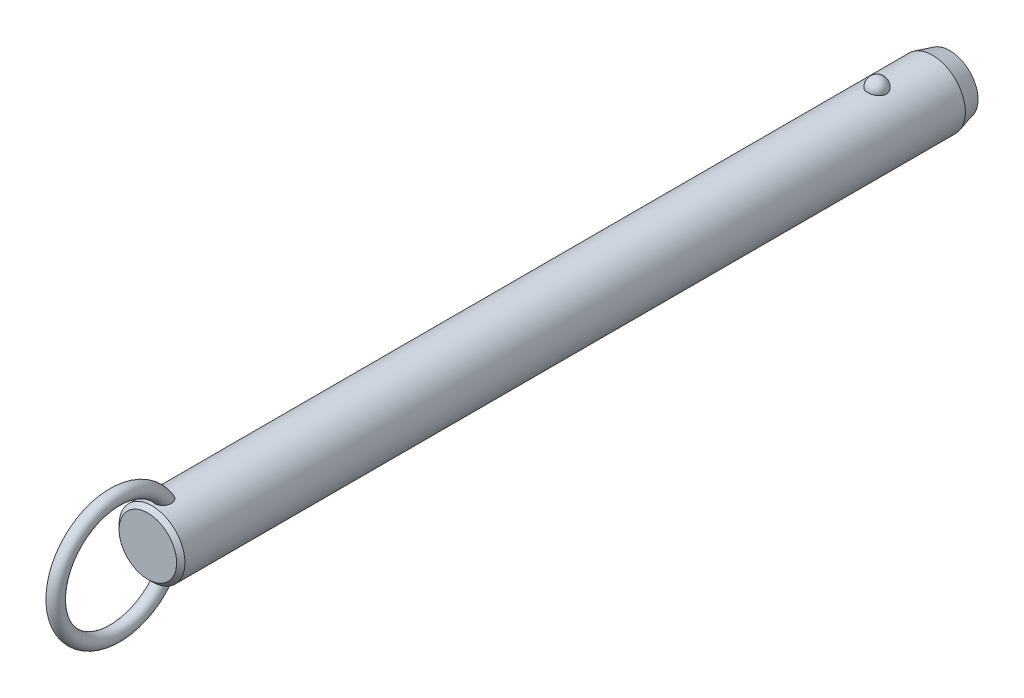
ISO-10303-21;
HEADER;
FILE_DESCRIPTION(('STEP AP214'),'2;1');
FILE_NAME('part.step','',(''),(''),'','','');
FILE_SCHEMA(('AUTOMOTIVE_DESIGN { 1 0 10303 214 1 1 1 1 }'));
ENDSEC;
DATA;
#1=APPLICATION_CONTEXT('core data for automotive mechanical design processes');
#2=APPLICATION_PROTOCOL_DEFINITION('international standard','automotive_design',2000,#1);
#3=PRODUCT_CONTEXT('',#1,'mechanical');
#4=PRODUCT('Part','Part','',(#3));
#5=PRODUCT_RELATED_PRODUCT_CATEGORY('part','',(#4));
#6=PRODUCT_DEFINITION_FORMATION('','',#4);
#7=PRODUCT_DEFINITION_CONTEXT('part definition',#1,'design');
#8=PRODUCT_DEFINITION('design','',#6,#7);
#9=PRODUCT_DEFINITION_SHAPE('','',#8);
#10=(LENGTH_UNIT() NAMED_UNIT(*) SI_UNIT(.MILLI.,.METRE.));
#11=(NAMED_UNIT(*) PLANE_ANGLE_UNIT() SI_UNIT($,.RADIAN.));
#12=(NAMED_UNIT(*) SI_UNIT($,.STERADIAN.) SOLID_ANGLE_UNIT());
#13=UNCERTAINTY_MEASURE_WITH_UNIT(LENGTH_MEASURE(1.E-05),#10,'distance_accuracy_value','');
#14=(GEOMETRIC_REPRESENTATION_CONTEXT(3) GLOBAL_UNCERTAINTY_ASSIGNED_CONTEXT((#13)) GLOBAL_UNIT_ASSIGNED_CONTEXT((#10,
#11,#12)) REPRESENTATION_CONTEXT('',''));
#15=CARTESIAN_POINT('',(0.,0.,0.));
#16=DIRECTION('',(0.,0.,1.));
#17=DIRECTION('',(1.,0.,0.));
#18=AXIS2_PLACEMENT_3D('',#15,#16,#17);
#19=CARTESIAN_POINT('',(0.,0.,198.12));
#20=DIRECTION('',(0.,0.,-1.));
#21=DIRECTION('',(-1.,0.,0.));
#22=AXIS2_PLACEMENT_3D('',#19,#20,#21);
#23=CYLINDRICAL_SURFACE('',#22,9.5);
#24=CARTESIAN_POINT('',(2.67259918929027,9.11631578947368,-2.70000000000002));
#25=CARTESIAN_POINT('',(2.6725968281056,9.11631786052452,-2.54909854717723));
#26=CARTESIAN_POINT('',(2.66030567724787,9.11994722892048,-2.39816735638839));
#27=CARTESIAN_POINT('',(2.6114347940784,9.13405924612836,-2.10058568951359));
#28=CARTESIAN_POINT('',(2.57484658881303,9.14454428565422,-1.95393672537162));
#29=CARTESIAN_POINT('',(2.47830875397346,9.17117631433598,-1.66916069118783));
#30=CARTESIAN_POINT('',(2.41836936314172,9.18732082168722,-1.53102991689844));
#31=CARTESIAN_POINT('',(2.27661331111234,9.22346780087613,-1.26705393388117));
#32=CARTESIAN_POINT('',(2.19479699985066,9.24347021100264,-1.14120852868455));
#33=CARTESIAN_POINT('',(2.01085282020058,9.28522401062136,-0.904632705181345));
#34=CARTESIAN_POINT('',(1.90862396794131,9.30698376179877,-0.793982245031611));
#35=CARTESIAN_POINT('',(1.6867437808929,9.34973971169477,-0.59160721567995));
#36=CARTESIAN_POINT('',(1.56709244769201,9.37073591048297,-0.499882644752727));
#37=CARTESIAN_POINT('',(1.31393976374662,9.40956370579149,-0.338167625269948));
#38=CARTESIAN_POINT('',(1.18048026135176,9.42740444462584,-0.268113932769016));
#39=CARTESIAN_POINT('',(0.903154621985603,9.45799906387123,-0.151390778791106));
#40=CARTESIAN_POINT('',(0.759289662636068,9.47075351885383,-0.104718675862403));
#41=CARTESIAN_POINT('',(0.468074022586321,9.48956256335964,-0.0367633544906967));
#42=CARTESIAN_POINT('',(0.320836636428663,9.49573643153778,-0.0150275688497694));
#43=CARTESIAN_POINT('',(0.0246714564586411,9.50112183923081,0.00396199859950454));
#44=CARTESIAN_POINT('',(-0.124256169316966,9.50033406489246,0.00121819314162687));
#45=CARTESIAN_POINT('',(-0.417264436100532,9.4919475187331,-0.0284441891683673));
#46=CARTESIAN_POINT('',(-0.56138413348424,9.48444885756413,-0.0550074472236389));
#47=CARTESIAN_POINT('',(-0.842986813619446,9.46357853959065,-0.131064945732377));
#48=CARTESIAN_POINT('',(-0.980469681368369,9.450206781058,-0.180559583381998));
#49=CARTESIAN_POINT('',(-1.24585005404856,9.41890822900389,-0.301476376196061));
#50=CARTESIAN_POINT('',(-1.37368611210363,9.40095498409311,-0.373026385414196));
#51=CARTESIAN_POINT('',(-1.61552738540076,9.36242964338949,-0.536025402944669));
#52=CARTESIAN_POINT('',(-1.72953116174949,9.34185727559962,-0.627476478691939));
#53=CARTESIAN_POINT('',(-1.9429225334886,9.29984568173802,-0.829844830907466));
#54=CARTESIAN_POINT('',(-2.04198021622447,9.27839736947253,-0.941108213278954));
#55=CARTESIAN_POINT('',(-2.22026460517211,9.23735994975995,-1.17883414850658));
#56=CARTESIAN_POINT('',(-2.29948985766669,9.21777097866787,-1.30529781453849));
#57=CARTESIAN_POINT('',(-2.43697287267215,9.18238994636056,-1.57158566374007));
#58=CARTESIAN_POINT('',(-2.49497068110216,9.16664569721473,-1.71155057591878));
#59=CARTESIAN_POINT('',(-2.5872073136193,9.14104303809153,-1.99961197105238));
#60=CARTESIAN_POINT('',(-2.62144683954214,9.13118445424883,-2.1477082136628));
#61=CARTESIAN_POINT('',(-2.66521466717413,9.11850622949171,-2.44715424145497));
#62=CARTESIAN_POINT('',(-2.67484831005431,9.11565658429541,-2.59848735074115));
#63=CARTESIAN_POINT('',(-2.66946735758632,9.11723375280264,-2.90067317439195));
#64=CARTESIAN_POINT('',(-2.65445345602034,9.12166036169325,-3.05152590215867));
#65=CARTESIAN_POINT('',(-2.60029711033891,9.13724422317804,-3.34766110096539));
#66=CARTESIAN_POINT('',(-2.56127978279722,9.14836656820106,-3.49296833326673));
#67=CARTESIAN_POINT('',(-2.46018844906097,9.17606676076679,-3.77477535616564));
#68=CARTESIAN_POINT('',(-2.39811349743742,9.1926448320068,-3.91127478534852));
#69=CARTESIAN_POINT('',(-2.25202303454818,9.22952198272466,-4.17244273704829));
#70=CARTESIAN_POINT('',(-2.16788714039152,9.24984129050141,-4.29704106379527));
#71=CARTESIAN_POINT('',(-1.9799408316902,9.29188255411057,-4.53013066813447));
#72=CARTESIAN_POINT('',(-1.87612963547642,9.31360456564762,-4.63862130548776));
#73=CARTESIAN_POINT('',(-1.65105429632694,9.35612959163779,-4.83690299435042));
#74=CARTESIAN_POINT('',(-1.52972405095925,9.37692871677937,-4.9266199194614));
#75=CARTESIAN_POINT('',(-1.27318250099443,9.41518970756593,-5.08429106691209));
#76=CARTESIAN_POINT('',(-1.13797219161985,9.432651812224,-5.15224684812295));
#77=CARTESIAN_POINT('',(-0.859280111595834,9.46208255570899,-5.26371827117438));
#78=CARTESIAN_POINT('',(-0.715925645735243,9.47411833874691,-5.30753421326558));
#79=CARTESIAN_POINT('',(-0.423550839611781,9.4916822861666,-5.37076321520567));
#80=CARTESIAN_POINT('',(-0.2745312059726,9.49721125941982,-5.39017930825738));
#81=CARTESIAN_POINT('',(0.0218446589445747,9.50110860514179,-5.40390587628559));
#82=CARTESIAN_POINT('',(0.16917707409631,9.49961381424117,-5.39869609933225));
#83=CARTESIAN_POINT('',(0.460808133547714,9.48993906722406,-5.36441955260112));
#84=CARTESIAN_POINT('',(0.605106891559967,9.48175936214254,-5.33535367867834));
#85=CARTESIAN_POINT('',(0.886027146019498,9.4596376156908,-5.25435587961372));
#86=CARTESIAN_POINT('',(1.02267710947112,9.44571881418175,-5.20251612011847));
#87=CARTESIAN_POINT('',(1.28523827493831,9.41358993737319,-5.07741549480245));
#88=CARTESIAN_POINT('',(1.41114877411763,9.39537958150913,-5.00415322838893));
#89=CARTESIAN_POINT('',(1.65085227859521,9.3562644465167,-4.83684599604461));
#90=CARTESIAN_POINT('',(1.76442346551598,9.33532178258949,-4.74249218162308));
#91=CARTESIAN_POINT('',(1.97425672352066,9.29321198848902,-4.53620389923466));
#92=CARTESIAN_POINT('',(2.07051582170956,9.27204482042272,-4.42426641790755));
#93=CARTESIAN_POINT('',(2.24490086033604,9.23139221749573,-4.18363183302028));
#94=CARTESIAN_POINT('',(2.32267019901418,9.21194380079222,-4.05466990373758));
#95=CARTESIAN_POINT('',(2.45584092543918,9.1773419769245,-3.78517836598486));
#96=CARTESIAN_POINT('',(2.5112497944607,9.16218713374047,-3.644652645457));
#97=CARTESIAN_POINT('',(2.59380876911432,9.13913522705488,-3.37104301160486));
#98=CARTESIAN_POINT('',(2.62330266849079,9.13064624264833,-3.23871053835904));
#99=CARTESIAN_POINT('',(2.66269870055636,9.11923566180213,-2.97092664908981));
#100=CARTESIAN_POINT('',(2.67260130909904,9.11631393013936,-2.83547530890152));
#101=CARTESIAN_POINT('',(2.67259918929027,9.11631578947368,-2.70000000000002));
#102=B_SPLINE_CURVE_WITH_KNOTS('',3,(#24,#25,#26,#27,#28,#29,#30,#31,#32,#33,#34,#35,#36,#37,
#38,#39,#40,#41,#42,#43,#44,#45,#46,#47,#48,#49,#50,#51,#52,#53,#54,#55,#56,#57,#58,#59,#60,#61,
#62,#63,#64,#65,#66,#67,#68,#69,#70,#71,#72,#73,#74,#75,#76,#77,#78,#79,#80,#81,#82,#83,#84,#85,
#86,#87,#88,#89,#90,#91,#92,#93,#94,#95,#96,#97,#98,#99,#100,#101),.UNSPECIFIED.,.T.,.F.,(4,2,2,
2,2,2,2,2,2,2,2,2,2,2,2,2,2,2,2,2,2,2,2,2,2,2,2,2,2,2,2,2,2,2,2,2,2,2,4),(0.,0.452217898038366,
0.904593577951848,1.35677112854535,1.80894144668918,2.26340676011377,2.71787203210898,
3.17099820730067,3.62407318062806,4.0687883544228,4.51345969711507,4.95160616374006,
5.38976021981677,5.83050358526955,6.27129275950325,6.72071308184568,7.17016633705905,
7.62495278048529,8.07972578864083,8.53254856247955,8.98535859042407,9.43582813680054,
9.88631615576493,10.3393155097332,10.7923328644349,11.2471065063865,11.7018475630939,
12.150795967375,12.599688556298,13.0398725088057,13.4800399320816,13.9184421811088,
14.3568730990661,14.802202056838,15.2476074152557,15.7010097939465,16.1542603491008,
16.5602594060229,16.966248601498),.UNSPECIFIED.);
#103=CARTESIAN_POINT('',(2.67259918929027,9.11631578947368,-2.70000000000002));
#104=VERTEX_POINT('',#103);
#105=EDGE_CURVE('E41',#104,#104,#102,.T.);
#106=ORIENTED_EDGE('',*,*,#105,.T.);
#107=EDGE_LOOP('',(#106));
#108=FACE_BOUND('',#107,.T.);
#109=CARTESIAN_POINT('',(0.,0.,206.44));
#110=DIRECTION('',(0.,0.,1.));
#111=DIRECTION('',(1.,0.,0.));
#112=AXIS2_PLACEMENT_3D('',#109,#110,#111);
#113=CIRCLE('',#112,9.5);
#114=CARTESIAN_POINT('',(9.5,0.,206.44));
#115=VERTEX_POINT('',#114);
#116=EDGE_CURVE('E10',#115,#115,#113,.F.);
#117=ORIENTED_EDGE('',*,*,#116,.T.);
#118=EDGE_LOOP('',(#117));
#119=FACE_BOUND('',#118,.T.);
#120=CARTESIAN_POINT('',(-0.697062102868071,-9.47439269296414,200.787808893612));
#121=CARTESIAN_POINT('',(-0.799579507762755,-9.46685146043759,200.827482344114));
#122=CARTESIAN_POINT('',(-0.898575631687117,-9.45788043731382,200.8759309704));
#123=CARTESIAN_POINT('',(-1.08670047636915,-9.43811593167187,200.988868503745));
#124=CARTESIAN_POINT('',(-1.17583204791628,-9.42732297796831,201.053352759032));
#125=CARTESIAN_POINT('',(-1.34179806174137,-9.40513672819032,201.196209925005));
#126=CARTESIAN_POINT('',(-1.41865133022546,-9.39374438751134,201.274561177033));
#127=CARTESIAN_POINT('',(-1.5586004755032,-9.37154196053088,201.442752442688));
#128=CARTESIAN_POINT('',(-1.62169476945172,-9.3607319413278,201.53259377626));
#129=CARTESIAN_POINT('',(-1.73527695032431,-9.34035749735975,201.724500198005));
#130=CARTESIAN_POINT('',(-1.78522266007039,-9.33085270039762,201.826891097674));
#131=CARTESIAN_POINT('',(-1.86924997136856,-9.3143834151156,202.038148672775));
#132=CARTESIAN_POINT('',(-1.90332570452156,-9.30741986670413,202.147017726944));
#133=CARTESIAN_POINT('',(-1.95893603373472,-9.29588482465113,202.380473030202));
#134=CARTESIAN_POINT('',(-1.97872420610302,-9.29165182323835,202.505489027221));
#135=CARTESIAN_POINT('',(-2.00062129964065,-9.28695978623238,202.757080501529));
#136=CARTESIAN_POINT('',(-2.00272284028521,-9.28650232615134,202.883656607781));
#137=CARTESIAN_POINT('',(-1.98958876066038,-9.28932750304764,203.156815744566));
#138=CARTESIAN_POINT('',(-1.97143366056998,-9.2932400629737,203.303251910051));
#139=CARTESIAN_POINT('',(-1.91479925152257,-9.30507151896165,203.592062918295));
#140=CARTESIAN_POINT('',(-1.87629122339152,-9.31299607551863,203.734431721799));
#141=CARTESIAN_POINT('',(-1.77225683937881,-9.33340232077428,204.035172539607));
#142=CARTESIAN_POINT('',(-1.70334898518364,-9.34641636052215,204.192369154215));
#143=CARTESIAN_POINT('',(-1.58111062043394,-9.36759153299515,204.417517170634));
#144=CARTESIAN_POINT('',(-1.53721459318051,-9.37492619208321,204.490796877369));
#145=CARTESIAN_POINT('',(-1.44302631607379,-9.38988566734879,204.63307405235));
#146=CARTESIAN_POINT('',(-1.39273721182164,-9.39751033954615,204.702073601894));
#147=CARTESIAN_POINT('',(-1.26775962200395,-9.41530678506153,204.856983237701));
#148=CARTESIAN_POINT('',(-1.19052326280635,-9.42548108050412,204.940871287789));
#149=CARTESIAN_POINT('',(-1.02420241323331,-9.44499825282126,205.096008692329));
#150=CARTESIAN_POINT('',(-0.935139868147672,-9.45434261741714,205.167280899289));
#151=CARTESIAN_POINT('',(-0.766610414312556,-9.46930670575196,205.278695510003));
#152=CARTESIAN_POINT('',(-0.689439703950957,-9.47529223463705,205.322235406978));
#153=CARTESIAN_POINT('',(-0.528942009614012,-9.48560294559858,205.39631336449));
#154=CARTESIAN_POINT('',(-0.445620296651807,-9.48992953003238,205.426862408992));
#155=CARTESIAN_POINT('',(-0.273901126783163,-9.49644161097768,205.472579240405));
#156=CARTESIAN_POINT('',(-0.18546574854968,-9.49860811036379,205.48761059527));
#157=CARTESIAN_POINT('',(-0.00734541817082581,-9.5004135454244,205.500149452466));
#158=CARTESIAN_POINT('',(0.0823387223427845,-9.50005405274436,205.497667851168));
#159=CARTESIAN_POINT('',(0.24767927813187,-9.49708301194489,205.476995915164));
#160=CARTESIAN_POINT('',(0.323620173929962,-9.49477609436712,205.460930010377));
#161=CARTESIAN_POINT('',(0.471981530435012,-9.48855917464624,205.417172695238));
#162=CARTESIAN_POINT('',(0.544400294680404,-9.48464840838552,205.389475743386));
#163=CARTESIAN_POINT('',(0.708947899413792,-9.47398336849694,205.31280266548));
#164=CARTESIAN_POINT('',(0.799149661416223,-9.46671310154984,205.259774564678));
#165=CARTESIAN_POINT('',(0.969783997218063,-9.45076225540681,205.139973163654));
#166=CARTESIAN_POINT('',(1.050194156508,-9.44207854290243,205.073169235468));
#167=CARTESIAN_POINT('',(1.23092343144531,-9.42051459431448,204.900759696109));
#168=CARTESIAN_POINT('',(1.32652499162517,-9.40733378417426,204.79026193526));
#169=CARTESIAN_POINT('',(1.49893121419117,-9.38140745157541,204.555561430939));
#170=CARTESIAN_POINT('',(1.57571616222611,-9.36866239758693,204.431344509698));
#171=CARTESIAN_POINT('',(1.71285426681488,-9.34457644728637,204.169389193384));
#172=CARTESIAN_POINT('',(1.77266365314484,-9.33328726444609,204.03136233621));
#173=CARTESIAN_POINT('',(1.87239208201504,-9.31379209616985,203.748051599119));
#174=CARTESIAN_POINT('',(1.91230158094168,-9.3055875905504,203.602764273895));
#175=CARTESIAN_POINT('',(1.97604189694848,-9.29228394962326,203.282028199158));
#176=CARTESIAN_POINT('',(1.9958743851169,-9.28797202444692,203.105724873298));
#177=CARTESIAN_POINT('',(2.0029570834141,-9.28645519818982,202.752414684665));
#178=CARTESIAN_POINT('',(1.99025930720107,-9.28923895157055,202.575409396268));
#179=CARTESIAN_POINT('',(1.93735479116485,-9.30038134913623,202.276338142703));
#180=CARTESIAN_POINT('',(1.90576827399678,-9.30697680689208,202.152667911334));
#181=CARTESIAN_POINT('',(1.8228748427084,-9.32356855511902,201.912329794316));
#182=CARTESIAN_POINT('',(1.77158213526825,-9.33356239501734,201.795656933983));
#183=CARTESIAN_POINT('',(1.64885744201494,-9.35602275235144,201.572706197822));
#184=CARTESIAN_POINT('',(1.57730995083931,-9.36850332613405,201.466492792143));
#185=CARTESIAN_POINT('',(1.41543264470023,-9.39431873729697,201.269553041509));
#186=CARTESIAN_POINT('',(1.32510883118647,-9.40765330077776,201.178821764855));
#187=CARTESIAN_POINT('',(1.13846223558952,-9.43195720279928,201.025033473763));
#188=CARTESIAN_POINT('',(1.04369890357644,-9.44302894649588,200.960094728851));
#189=CARTESIAN_POINT('',(0.843965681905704,-9.46296805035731,200.848038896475));
#190=CARTESIAN_POINT('',(0.739000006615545,-9.47183631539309,200.800914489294));
#191=CARTESIAN_POINT('',(0.528175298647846,-9.48586140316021,200.728117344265));
#192=CARTESIAN_POINT('',(0.422686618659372,-9.49119633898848,200.70140249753));
#193=CARTESIAN_POINT('',(0.208590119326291,-9.49831365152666,200.666013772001));
#194=CARTESIAN_POINT('',(0.0999817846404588,-9.500095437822,200.657342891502));
#195=CARTESIAN_POINT('',(-0.126104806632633,-9.49988861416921,200.658350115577));
#196=CARTESIAN_POINT('',(-0.243578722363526,-9.49757821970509,200.669594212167));
#197=CARTESIAN_POINT('',(-0.474390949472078,-9.48885165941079,200.713167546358));
#198=CARTESIAN_POINT('',(-0.587729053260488,-9.48243528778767,200.745497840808));
#199=CARTESIAN_POINT('',(-0.697062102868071,-9.47439269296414,200.787808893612));
#200=B_SPLINE_CURVE_WITH_KNOTS('',3,(#120,#121,#122,#123,#124,#125,#126,#127,#128,#129,#130,
#131,#132,#133,#134,#135,#136,#137,#138,#139,#140,#141,#142,#143,#144,#145,#146,#147,#148,#149,
#150,#151,#152,#153,#154,#155,#156,#157,#158,#159,#160,#161,#162,#163,#164,#165,#166,#167,#168,
#169,#170,#171,#172,#173,#174,#175,#176,#177,#178,#179,#180,#181,#182,#183,#184,#185,#186,#187,
#188,#189,#190,#191,#192,#193,#194,#195,#196,#197,#198,#199),.UNSPECIFIED.,.T.,.F.,(4,2,2,2,2,2,
2,2,2,2,2,2,2,2,2,2,2,2,2,2,2,2,2,2,2,2,2,2,2,2,2,2,2,2,2,2,2,2,2,4),(0.,0.330119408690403,
0.660143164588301,0.989655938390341,1.31920659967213,1.66074728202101,2.00241415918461,
2.38088696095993,2.75951768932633,3.20065679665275,3.64242004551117,4.15620996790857,
4.41314162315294,4.66994734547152,5.01228664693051,5.35399933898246,5.61943037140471,
5.88463652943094,6.15215502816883,6.4195070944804,6.65144391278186,6.88349136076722,
7.19641200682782,7.51003602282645,7.94779711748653,8.3860149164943,8.83699707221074,
9.28819530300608,9.81778662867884,10.34653170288,10.7284172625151,11.1100280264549,
11.4938603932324,11.8775702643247,12.2220189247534,12.5663259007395,12.8915939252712,
13.2169159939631,13.5689650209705,13.9210316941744),.UNSPECIFIED.);
#201=CARTESIAN_POINT('',(-0.697062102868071,-9.47439269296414,200.787808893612));
#202=VERTEX_POINT('',#201);
#203=EDGE_CURVE('E60',#202,#202,#200,.T.);
#204=ORIENTED_EDGE('',*,*,#203,.T.);
#205=EDGE_LOOP('',(#204));
#206=FACE_BOUND('',#205,.T.);
#207=CARTESIAN_POINT('',(-0.697062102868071,9.47439269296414,200.787808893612));
#208=CARTESIAN_POINT('',(-0.597792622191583,9.48169483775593,200.74939564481));
#209=CARTESIAN_POINT('',(-0.495106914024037,9.48766580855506,200.719168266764));
#210=CARTESIAN_POINT('',(-0.285876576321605,9.49627648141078,200.676032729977));
#211=CARTESIAN_POINT('',(-0.179324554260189,9.49890941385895,200.663159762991));
#212=CARTESIAN_POINT('',(0.0344157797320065,9.50053798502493,200.655166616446));
#213=CARTESIAN_POINT('',(0.141603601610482,9.49953613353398,200.660034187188));
#214=CARTESIAN_POINT('',(0.35356357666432,9.49401038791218,200.687365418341));
#215=CARTESIAN_POINT('',(0.458336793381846,9.48948807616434,200.70982117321));
#216=CARTESIAN_POINT('',(0.662493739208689,9.4774236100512,200.771671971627));
#217=CARTESIAN_POINT('',(0.761881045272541,9.46988348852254,200.811055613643));
#218=CARTESIAN_POINT('',(0.95260839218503,9.45260382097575,200.905634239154));
#219=CARTESIAN_POINT('',(1.04394806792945,9.44286417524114,200.960829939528));
#220=CARTESIAN_POINT('',(1.21712767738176,9.42211760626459,201.086066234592));
#221=CARTESIAN_POINT('',(1.29885671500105,9.41109835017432,201.156257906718));
#222=CARTESIAN_POINT('',(1.44978975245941,9.38903310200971,201.308980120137));
#223=CARTESIAN_POINT('',(1.51899278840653,9.37798710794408,201.391511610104));
#224=CARTESIAN_POINT('',(1.64602857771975,9.35654375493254,201.569776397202));
#225=CARTESIAN_POINT('',(1.70333052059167,9.34618688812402,201.665891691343));
#226=CARTESIAN_POINT('',(1.80259341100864,9.32755128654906,201.865897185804));
#227=CARTESIAN_POINT('',(1.84454942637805,9.31927322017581,201.969789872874));
#228=CARTESIAN_POINT('',(1.91637039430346,9.30478365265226,202.192213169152));
#229=CARTESIAN_POINT('',(1.944805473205,9.29882552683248,202.311219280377));
#230=CARTESIAN_POINT('',(1.98449865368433,9.29043398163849,202.552143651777));
#231=CARTESIAN_POINT('',(1.99574908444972,9.28800213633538,202.674063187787));
#232=CARTESIAN_POINT('',(2.00275141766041,9.28649645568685,202.936932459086));
#233=CARTESIAN_POINT('',(1.99588238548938,9.28799035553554,203.077952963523));
#234=CARTESIAN_POINT('',(1.96270559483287,9.29505517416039,203.357621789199));
#235=CARTESIAN_POINT('',(1.93637872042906,9.30063010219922,203.496267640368));
#236=CARTESIAN_POINT('',(1.85949176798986,9.31633564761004,203.792561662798));
#237=CARTESIAN_POINT('',(1.80549792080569,9.3270926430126,203.949290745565));
#238=CARTESIAN_POINT('',(1.67376869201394,9.3516306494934,204.252284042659));
#239=CARTESIAN_POINT('',(1.59603181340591,9.36541185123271,204.398547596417));
#240=CARTESIAN_POINT('',(1.4360277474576,9.39110706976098,204.645813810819));
#241=CARTESIAN_POINT('',(1.35831795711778,9.40278656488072,204.749791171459));
#242=CARTESIAN_POINT('',(1.18774483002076,9.42585025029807,204.944534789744));
#243=CARTESIAN_POINT('',(1.09490932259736,9.43723493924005,205.035324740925));
#244=CARTESIAN_POINT('',(0.921110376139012,9.45552616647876,205.17620334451));
#245=CARTESIAN_POINT('',(0.843738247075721,9.46281058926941,205.230656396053));
#246=CARTESIAN_POINT('',(0.681245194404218,9.47589120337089,205.326711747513));
#247=CARTESIAN_POINT('',(0.596135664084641,9.48168953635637,205.368332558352));
#248=CARTESIAN_POINT('',(0.433779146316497,9.49038144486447,205.430089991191));
#249=CARTESIAN_POINT('',(0.357459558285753,9.49359170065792,205.45260136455));
#250=CARTESIAN_POINT('',(0.202074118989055,9.49816761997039,205.484574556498));
#251=CARTESIAN_POINT('',(0.123010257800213,9.49953459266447,205.494045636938));
#252=CARTESIAN_POINT('',(-0.03573724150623,9.50026497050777,205.499114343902));
#253=CARTESIAN_POINT('',(-0.115421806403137,9.49962433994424,205.494684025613));
#254=CARTESIAN_POINT('',(-0.272823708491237,9.49640854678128,205.472296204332));
#255=CARTESIAN_POINT('',(-0.350540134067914,9.4938325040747,205.454332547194));
#256=CARTESIAN_POINT('',(-0.500580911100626,9.48709462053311,205.406802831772));
#257=CARTESIAN_POINT('',(-0.572979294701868,9.48296359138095,205.377461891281));
#258=CARTESIAN_POINT('',(-0.712864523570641,9.47347609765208,205.309008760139));
#259=CARTESIAN_POINT('',(-0.780349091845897,9.46811906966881,205.269892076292));
#260=CARTESIAN_POINT('',(-0.946309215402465,9.45329720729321,205.159432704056));
#261=CARTESIAN_POINT('',(-1.04090230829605,9.44321512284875,205.082329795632));
#262=CARTESIAN_POINT('',(-1.21661929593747,9.42219227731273,204.91409718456));
#263=CARTESIAN_POINT('',(-1.29770519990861,9.41124921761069,204.822929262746));
#264=CARTESIAN_POINT('',(-1.47319646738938,9.38563439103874,204.596162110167));
#265=CARTESIAN_POINT('',(-1.56208878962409,9.37102009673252,204.456289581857));
#266=CARTESIAN_POINT('',(-1.71623987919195,9.34401559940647,204.163950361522));
#267=CARTESIAN_POINT('',(-1.78147866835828,9.33162728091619,204.011473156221));
#268=CARTESIAN_POINT('',(-1.88853837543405,9.31055541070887,203.695647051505));
#269=CARTESIAN_POINT('',(-1.92998995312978,9.30193076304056,203.532168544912));
#270=CARTESIAN_POINT('',(-1.98590726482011,9.29015757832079,203.200526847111));
#271=CARTESIAN_POINT('',(-2.0004070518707,9.2870021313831,203.032369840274));
#272=CARTESIAN_POINT('',(-1.99964701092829,9.28716218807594,202.725080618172));
#273=CARTESIAN_POINT('',(-1.98908145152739,9.28945704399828,202.585936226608));
#274=CARTESIAN_POINT('',(-1.94566294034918,9.29865169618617,202.311153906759));
#275=CARTESIAN_POINT('',(-1.9128206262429,9.30554929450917,202.175514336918));
#276=CARTESIAN_POINT('',(-1.84582133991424,9.31898248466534,201.977802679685));
#277=CARTESIAN_POINT('',(-1.82038084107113,9.32400364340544,201.912583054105));
#278=CARTESIAN_POINT('',(-1.76350511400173,9.33492884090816,201.784903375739));
#279=CARTESIAN_POINT('',(-1.73207305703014,9.34083241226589,201.722441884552));
#280=CARTESIAN_POINT('',(-1.66324243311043,9.35333332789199,201.60094078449));
#281=CARTESIAN_POINT('',(-1.62584239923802,9.35993084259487,201.541902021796));
#282=CARTESIAN_POINT('',(-1.54527678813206,9.37356864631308,201.427987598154));
#283=CARTESIAN_POINT('',(-1.50211241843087,9.38060884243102,201.373111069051));
#284=CARTESIAN_POINT('',(-1.3768114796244,9.40004442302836,201.229961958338));
#285=CARTESIAN_POINT('',(-1.28916358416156,9.41261047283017,201.146429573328));
#286=CARTESIAN_POINT('',(-1.09996826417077,9.43658180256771,200.997236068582));
#287=CARTESIAN_POINT('',(-0.998461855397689,9.44799034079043,200.931523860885));
#288=CARTESIAN_POINT('',(-0.860188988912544,9.46103017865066,200.8594367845));
#289=CARTESIAN_POINT('',(-0.828141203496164,9.46389141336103,200.843851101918));
#290=CARTESIAN_POINT('',(-0.763210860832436,9.46934915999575,200.814473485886));
#291=CARTESIAN_POINT('',(-0.730328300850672,9.47194567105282,200.800681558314));
#292=CARTESIAN_POINT('',(-0.697062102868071,9.47439269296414,200.787808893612));
#293=B_SPLINE_CURVE_WITH_KNOTS('',3,(#207,#208,#209,#210,#211,#212,#213,#214,#215,#216,#217,
#218,#219,#220,#221,#222,#223,#224,#225,#226,#227,#228,#229,#230,#231,#232,#233,#234,#235,#236,
#237,#238,#239,#240,#241,#242,#243,#244,#245,#246,#247,#248,#249,#250,#251,#252,#253,#254,#255,
#256,#257,#258,#259,#260,#261,#262,#263,#264,#265,#266,#267,#268,#269,#270,#271,#272,#273,#274,
#275,#276,#277,#278,#279,#280,#281,#282,#283,#284,#285,#286,#287,#288,#289,#290,#291,#292),
.UNSPECIFIED.,.T.,.F.,(4,2,2,2,2,2,2,2,2,2,2,2,2,2,2,2,2,2,2,2,2,2,2,2,2,2,2,2,2,2,2,2,2,2,2,2,
2,2,2,2,2,2,4),(0.,0.319942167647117,0.640532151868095,0.96090081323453,1.2811255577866,
1.60113495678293,1.92115886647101,2.24457323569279,2.56801248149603,2.90371927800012,
3.23953387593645,3.60560313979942,3.97183576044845,4.39383693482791,4.8162532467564,
5.31257045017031,5.80891895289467,6.19868344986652,6.58773876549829,6.87145417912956,
7.15475838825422,7.39263751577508,7.63034760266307,7.86853584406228,8.10683246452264,
8.3406366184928,8.57454843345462,8.93983939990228,9.30614105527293,9.80266668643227,
10.2996107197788,10.8040753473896,11.3079021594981,11.7249776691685,12.1418541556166,
12.3521485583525,12.5623319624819,12.7725671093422,12.9827582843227,13.345827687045,
13.7078449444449,13.8150604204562,13.9222762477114),.UNSPECIFIED.);
#294=CARTESIAN_POINT('',(-0.697062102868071,9.47439269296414,200.787808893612));
#295=VERTEX_POINT('',#294);
#296=EDGE_CURVE('E67',#295,#295,#293,.T.);
#297=ORIENTED_EDGE('',*,*,#296,.T.);
#298=EDGE_LOOP('',(#297));
#299=FACE_BOUND('',#298,.T.);
#300=CARTESIAN_POINT('',(0.,0.,-18.6999999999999));
#301=DIRECTION('',(0.,0.,-1.));
#302=DIRECTION('',(-1.,0.,0.));
#303=AXIS2_PLACEMENT_3D('',#300,#301,#302);
#304=CIRCLE('',#303,9.5);
#305=CARTESIAN_POINT('',(-9.5,0.,-18.6999999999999));
#306=VERTEX_POINT('',#305);
#307=EDGE_CURVE('E57',#306,#306,#304,.F.);
#308=ORIENTED_EDGE('',*,*,#307,.T.);
#309=EDGE_LOOP('',(#308));
#310=FACE_BOUND('',#309,.T.);
#311=ADVANCED_FACE('F37',(#108,#119,#206,#299,#310),#23,.T.);
#312=CARTESIAN_POINT('',(0.,0.,-23.7));
#313=DIRECTION('',(0.,0.,-1.));
#314=DIRECTION('',(-1.,0.,0.));
#315=AXIS2_PLACEMENT_3D('',#312,#313,#314);
#316=PLANE('',#315);
#317=CARTESIAN_POINT('',(0.,0.,-23.7));
#318=DIRECTION('',(0.,0.,-1.));
#319=DIRECTION('',(-1.,0.,0.));
#320=AXIS2_PLACEMENT_3D('',#317,#318,#319);
#321=CIRCLE('',#320,8.16025403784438);
#322=CARTESIAN_POINT('',(-8.16025403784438,0.,-23.7));
#323=VERTEX_POINT('',#322);
#324=EDGE_CURVE('E66',#323,#323,#321,.T.);
#325=ORIENTED_EDGE('',*,*,#324,.T.);
#326=EDGE_LOOP('',(#325));
#327=FACE_BOUND('',#326,.T.);
#328=ADVANCED_FACE('F85',(#327),#316,.T.);
#329=CARTESIAN_POINT('',(0.,0.,-23.7));
#330=DIRECTION('',(0.,0.,1.));
#331=DIRECTION('',(1.,0.,0.));
#332=AXIS2_PLACEMENT_3D('',#329,#330,#331);
#333=CONICAL_SURFACE('',#332,8.16025403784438,0.261799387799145);
#334=ORIENTED_EDGE('',*,*,#307,.F.);
#335=EDGE_LOOP('',(#334));
#336=FACE_BOUND('',#335,.T.);
#337=ORIENTED_EDGE('',*,*,#324,.F.);
#338=EDGE_LOOP('',(#337));
#339=FACE_BOUND('',#338,.T.);
#340=ADVANCED_FACE('F83',(#336,#339),#333,.T.);
#341=CARTESIAN_POINT('',(0.,0.,207.64));
#342=DIRECTION('',(0.,0.,1.));
#343=DIRECTION('',(1.,0.,0.));
#344=AXIS2_PLACEMENT_3D('',#341,#342,#343);
#345=PLANE('',#344);
#346=CARTESIAN_POINT('',(0.,0.,207.64));
#347=DIRECTION('',(0.,0.,1.));
#348=DIRECTION('',(1.,0.,0.));
#349=AXIS2_PLACEMENT_3D('',#346,#347,#348);
#350=CIRCLE('',#349,8.3);
#351=CARTESIAN_POINT('',(8.3,0.,207.64));
#352=VERTEX_POINT('',#351);
#353=EDGE_CURVE('E50',#352,#352,#350,.T.);
#354=ORIENTED_EDGE('',*,*,#353,.T.);
#355=EDGE_LOOP('',(#354));
#356=FACE_BOUND('',#355,.T.);
#357=ADVANCED_FACE('F77',(#356),#345,.T.);
#358=CARTESIAN_POINT('',(0.,0.,217.17));
#359=DIRECTION('',(1.,0.,0.));
#360=DIRECTION('',(0.,0.,-1.));
#361=AXIS2_PLACEMENT_3D('',#358,#359,#360);
#362=TOROIDAL_SURFACE('',#361,17.05,2.);
#363=ORIENTED_EDGE('',*,*,#296,.F.);
#364=EDGE_LOOP('',(#363));
#365=FACE_BOUND('',#364,.T.);
#366=ORIENTED_EDGE('',*,*,#203,.F.);
#367=EDGE_LOOP('',(#366));
#368=FACE_BOUND('',#367,.T.);
#369=ADVANCED_FACE('F73',(#365,#368),#362,.T.);
#370=CARTESIAN_POINT('',(0.,0.,207.64));
#371=DIRECTION('',(0.,0.,-1.));
#372=DIRECTION('',(-1.,0.,0.));
#373=AXIS2_PLACEMENT_3D('',#370,#371,#372);
#374=CONICAL_SURFACE('',#373,8.3,0.785398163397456);
#375=ORIENTED_EDGE('',*,*,#116,.F.);
#376=EDGE_LOOP('',(#375));
#377=FACE_BOUND('',#376,.T.);
#378=ORIENTED_EDGE('',*,*,#353,.F.);
#379=EDGE_LOOP('',(#378));
#380=FACE_BOUND('',#379,.T.);
#381=ADVANCED_FACE('F39',(#377,#380),#374,.T.);
#382=CARTESIAN_POINT('',(0.,9.5,-2.70000000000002));
#383=DIRECTION('',(0.,1.,0.));
#384=DIRECTION('',(0.,0.,-1.));
#385=AXIS2_PLACEMENT_3D('',#382,#383,#384);
#386=SPHERICAL_SURFACE('',#385,2.7);
#387=ORIENTED_EDGE('',*,*,#105,.F.);
#388=EDGE_LOOP('',(#387));
#389=FACE_BOUND('',#388,.T.);
#390=ADVANCED_FACE('F79',(#389),#386,.T.);
#391=CLOSED_SHELL('',(#311,#328,#340,#357,#369,#381,#390));
#392=MANIFOLD_SOLID_BREP('B2',#391);
#393=ADVANCED_BREP_SHAPE_REPRESENTATION('',(#18,#392),#14);
#394=SHAPE_DEFINITION_REPRESENTATION(#9,#393);
ENDSEC;
END-ISO-10303-21;
